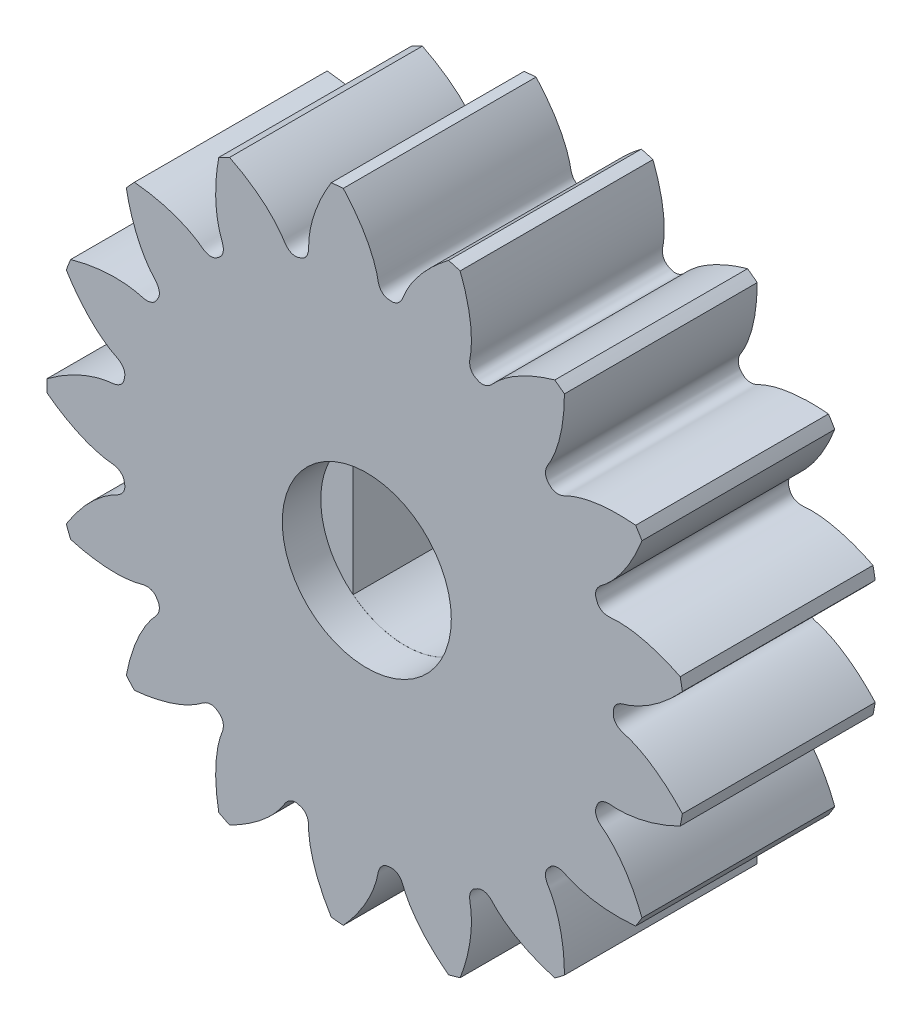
from build123d import *

# Parameters (mm, degrees)
SKETCHREVOLVESPURGEAR1_W       = 6
SKETCHREVOLVESPURGEAR1_H       = 9.95804671
TOOTHEXTRUDECUTSPURGEAR1_DEPTH = 5
PATTERNSPURGEAR1_COUNT         = 17
BOREREVOLVESKETCH_W            = 10
BOREREVOLVESKETCH_H            = 0.5
CUT_EXTRUDE_2_DEPTH            = 16.290177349
SKETCH_2_R                     = 2.63
CUT_EXTRUDE_3_DEPTH            = 1.2


with BuildPart() as part:
    # SketchRevolveSpurGear1 → SpurGear1 (revolve)
    with BuildSketch(Plane(origin=(0, 0, 0), x_dir=(0, 0, -1), z_dir=(1, 0, 0)), mode=Mode.PRIVATE) as spurgear1_sk:
        with Locations((2, 4.979023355)):
            Rectangle(SKETCHREVOLVESPURGEAR1_W, SKETCHREVOLVESPURGEAR1_H)
    revolve(spurgear1_sk.sketch.rotate(Axis((0, 0, 0), (0, 0, -1)), 90), axis=Axis((0, 0, 0), (0, 0, -1)))

    # SketchToothSpurGear1 → ToothExtrudeCutSpurGear1 (cut, symmetric)
    with BuildSketch(Plane.XY):
        with BuildLine():
            ThreePointArc((9.877560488, 1.708028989), (10.024149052, 0), (9.877560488, -1.708028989))
            add(Edge.make_bspline(
                [(9.877560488, -1.708028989), (9.843186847, -1.669208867), (9.796961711, -1.618291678), (9.738426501, -1.555977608), (9.703757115, -1.519686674), (9.669169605, -1.484085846), (9.634673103, -1.449171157), (9.600276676, -1.414938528), (9.56598933, -1.381383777), (9.531820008, -1.348502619), (9.497777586, -1.316290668), (9.463870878, -1.284743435), (9.430108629, -1.253856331), (9.396499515, -1.223624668), (9.363052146, -1.194043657), (9.32977506, -1.165108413), (9.296676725, -1.136813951), (9.263765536, -1.109155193), (9.231049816, -1.082126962), (9.198537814, -1.055723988), (9.166237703, -1.029940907), (9.134157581, -1.004772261), (9.102305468, -0.980212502), (9.070689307, -0.956255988), (9.03931696, -0.932896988), (9.008196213, -0.910129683), (8.977334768, -0.887948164), (8.946740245, -0.866346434), (8.916420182, -0.845318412), (8.886382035, -0.824857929), (8.856633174, -0.804958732), (8.827180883, -0.785614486), (8.798032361, -0.766818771), (8.769194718, -0.748565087), (8.740674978, -0.730846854), (8.712480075, -0.713657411), (8.684616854, -0.696990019), (8.657092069, -0.680837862), (8.629912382, -0.665194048), (8.603084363, -0.650051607), (8.57661449, -0.635403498), (8.550509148, -0.621242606), (8.524774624, -0.607561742), (8.499417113, -0.594353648), (8.474442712, -0.581610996), (8.449857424, -0.569326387), (8.42566715, -0.557492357), (8.401877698, -0.546101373), (8.378494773, -0.535145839), (8.355523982, -0.524618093), (8.332970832, -0.51451041), (8.310840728, -0.504815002), (8.289138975, -0.495524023), (8.267870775, -0.486629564), (8.247041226, -0.478123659), (8.226655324, -0.469998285), (8.206717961, -0.462245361), (8.187233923, -0.454856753), (8.168207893, -0.447824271), (8.149644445, -0.441139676), (8.131548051, -0.434794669), (8.113923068, -0.428780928), (8.096773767, -0.423089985), (8.080104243, -0.417713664), (8.06391872, -0.412642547), (8.048220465, -0.407871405), (8.033015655, -0.403379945), (7.998613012, -0.393610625), (7.962548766, -0.383439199), (7.925927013, -0.369321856), (7.906756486, -0.361217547), (7.887813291, -0.352367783), (7.869060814, -0.342698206), (7.850471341, -0.332095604), (7.832023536, -0.320427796), (7.813710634, -0.307533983), (7.795549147, -0.293224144), (7.777591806, -0.277278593), (7.759944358, -0.259452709), (7.742786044, -0.239489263), (7.726391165, -0.217142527), (7.711147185, -0.192217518), (7.697556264, -0.1646257), (7.686222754, -0.134448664), (7.677756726, -0.10200325), (7.673123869, -0.06988457), (7.671489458, -0.035687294), (7.672366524, 0), (7.671489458, 0.035687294), (7.673123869, 0.06988457), (7.677756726, 0.10200325), (7.686222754, 0.134448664), (7.697556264, 0.1646257), (7.711147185, 0.192217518), (7.726391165, 0.217142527), (7.742786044, 0.239489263), (7.759944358, 0.259452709), (7.777591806, 0.277278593), (7.795549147, 0.293224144), (7.813710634, 0.307533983), (7.832023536, 0.320427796), (7.850471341, 0.332095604), (7.869060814, 0.342698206), (7.887813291, 0.352367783), (7.906756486, 0.361217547), (7.925927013, 0.369321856), (7.962548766, 0.383439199), (7.998613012, 0.393610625), (8.033015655, 0.403379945), (8.048220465, 0.407871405), (8.06391872, 0.412642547), (8.080104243, 0.417713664), (8.096773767, 0.423089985), (8.113923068, 0.428780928), (8.131548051, 0.434794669), (8.149644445, 0.441139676), (8.168207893, 0.447824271), (8.187233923, 0.454856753), (8.206717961, 0.462245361), (8.226655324, 0.469998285), (8.247041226, 0.478123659), (8.267870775, 0.486629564), (8.289138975, 0.495524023), (8.310840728, 0.504815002), (8.332970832, 0.51451041), (8.355523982, 0.524618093), (8.378494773, 0.535145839), (8.401877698, 0.546101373), (8.42566715, 0.557492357), (8.449857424, 0.569326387), (8.474442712, 0.581610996), (8.499417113, 0.594353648), (8.524774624, 0.607561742), (8.550509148, 0.621242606), (8.57661449, 0.635403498), (8.603084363, 0.650051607), (8.629912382, 0.665194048), (8.657092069, 0.680837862), (8.684616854, 0.696990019), (8.712480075, 0.713657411), (8.740674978, 0.730846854), (8.769194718, 0.748565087), (8.798032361, 0.766818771), (8.827180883, 0.785614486), (8.856633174, 0.804958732), (8.886382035, 0.824857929), (8.916420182, 0.845318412), (8.946740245, 0.866346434), (8.977334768, 0.887948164), (9.008196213, 0.910129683), (9.03931696, 0.932896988), (9.070689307, 0.956255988), (9.102305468, 0.980212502), (9.134157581, 1.004772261), (9.166237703, 1.029940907), (9.198537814, 1.055723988), (9.231049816, 1.082126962), (9.263765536, 1.109155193), (9.296676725, 1.136813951), (9.32977506, 1.165108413), (9.363052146, 1.194043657), (9.396499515, 1.223624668), (9.430108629, 1.253856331), (9.463870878, 1.284743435), (9.497777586, 1.316290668), (9.531820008, 1.348502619), (9.56598933, 1.381383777), (9.600276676, 1.414938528), (9.634673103, 1.449171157), (9.669169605, 1.484085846), (9.703757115, 1.519686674), (9.738426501, 1.555977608), (9.796961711, 1.618291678), (9.843186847, 1.669208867), (9.877560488, 1.708028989)],
                knots=[0, 0, 0, 0, 0.026993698, 0.035799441, 0.04450908, 0.053122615, 0.061640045, 0.070061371, 0.078386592, 0.086615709, 0.094748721, 0.102785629, 0.110726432, 0.118571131, 0.126319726, 0.133972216, 0.141528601, 0.148988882, 0.156353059, 0.163621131, 0.170793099, 0.177868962, 0.184848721, 0.191732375, 0.198519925, 0.20521137, 0.211806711, 0.218305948, 0.22470908, 0.231016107, 0.23722703, 0.243341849, 0.249360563, 0.255283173, 0.261109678, 0.266840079, 0.272474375, 0.278012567, 0.283454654, 0.288800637, 0.294050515, 0.299204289, 0.304261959, 0.309223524, 0.314088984, 0.31885834, 0.323531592, 0.328108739, 0.332589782, 0.33697472, 0.341263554, 0.345456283, 0.349552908, 0.353553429, 0.357457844, 0.361266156, 0.364978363, 0.368594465, 0.372114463, 0.375538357, 0.378866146, 0.382097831, 0.385233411, 0.388272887, 0.391216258, 0.394063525, 0.396814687, 0.399469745, 0.412684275, 0.416289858, 0.419896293, 0.423518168, 0.427172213, 0.430877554, 0.434655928, 0.438531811, 0.442532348, 0.446686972, 0.451026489, 0.455581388, 0.460379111, 0.46544009, 0.470772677, 0.476367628, 0.482193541, 0.488195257, 0.493226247, 0.5, 0.506773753, 0.511804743, 0.517806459, 0.523632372, 0.529227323, 0.53455991, 0.539620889, 0.544418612, 0.548973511, 0.553313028, 0.557467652, 0.561468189, 0.565344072, 0.569122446, 0.572827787, 0.576481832, 0.580103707, 0.583710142, 0.587315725, 0.600530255, 0.603185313, 0.605936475, 0.608783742, 0.611727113, 0.614766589, 0.617902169, 0.621133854, 0.624461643, 0.627885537, 0.631405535, 0.635021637, 0.638733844, 0.642542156, 0.646446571, 0.650447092, 0.654543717, 0.658736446, 0.66302528, 0.667410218, 0.671891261, 0.676468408, 0.68114166, 0.685911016, 0.690776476, 0.695738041, 0.700795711, 0.705949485, 0.711199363, 0.716545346, 0.721987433, 0.727525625, 0.733159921, 0.738890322, 0.744716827, 0.750639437, 0.756658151, 0.76277297, 0.768983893, 0.77529092, 0.781694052, 0.788193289, 0.79478863, 0.801480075, 0.808267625, 0.815151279, 0.822131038, 0.829206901, 0.836378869, 0.843646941, 0.851011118, 0.858471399, 0.866027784, 0.873680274, 0.881428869, 0.889273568, 0.897214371, 0.905251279, 0.913384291, 0.921613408, 0.929938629, 0.938359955, 0.946877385, 0.95549092, 0.964200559, 0.973006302, 1, 1, 1, 1], degree=3))
        make_face()
    toothextrudecutspurgear1 = extrude(amount=TOOTHEXTRUDECUTSPURGEAR1_DEPTH, both=True, mode=Mode.SUBTRACT)

    # PatternSpurGear1: ToothExtrudeCutSpurGear1 ×17 about axis
    patternspurgear1_axis = Axis((0, 0, 50), (0, 0, -1))
    for i in range(1, PATTERNSPURGEAR1_COUNT):
        add(toothextrudecutspurgear1.rotate(patternspurgear1_axis, i * 360 / PATTERNSPURGEAR1_COUNT), mode=Mode.SUBTRACT)

    # BoreRevolveSketch → BoreRevolveCut (revolve, cut)
    with BuildSketch(Plane(origin=(0, 0, 0), x_dir=(0, 0, -1), z_dir=(1, 0, 0)), mode=Mode.PRIVATE) as borerevolvecut_sk:
        with Locations((0, 0.25)):
            Rectangle(BOREREVOLVESKETCH_W, BOREREVOLVESKETCH_H)
    revolve(borerevolvecut_sk.sketch.rotate(Axis((0, 0, 0), (0, 0, -1)), 90), axis=Axis((0, 0, 0), (0, 0, -1)), mode=Mode.SUBTRACT)

    # Sketch 1 → Cut-Extrude 2 (cut, through all)
    with BuildSketch(Plane.XY.offset(1)):
        with BuildLine():
            Line((1.625, 2.065371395), (1.625, -2.065371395))
            ThreePointArc((1.625, -2.065371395), (0, -2.628), (-1.625, -2.065371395))
            Line((-1.625, -2.065371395), (-1.625, 2.065371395))
            ThreePointArc((-1.625, 2.065371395), (0, 2.628), (1.625, 2.065371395))
        make_face()
    extrude(amount=-CUT_EXTRUDE_2_DEPTH, mode=Mode.SUBTRACT)

    # Sketch 2 → Cut-Extrude 3 (cut)
    with BuildSketch(Plane.XY.offset(1)):
        Circle(SKETCH_2_R)
    extrude(amount=-CUT_EXTRUDE_3_DEPTH, mode=Mode.SUBTRACT)


solid = part.part
